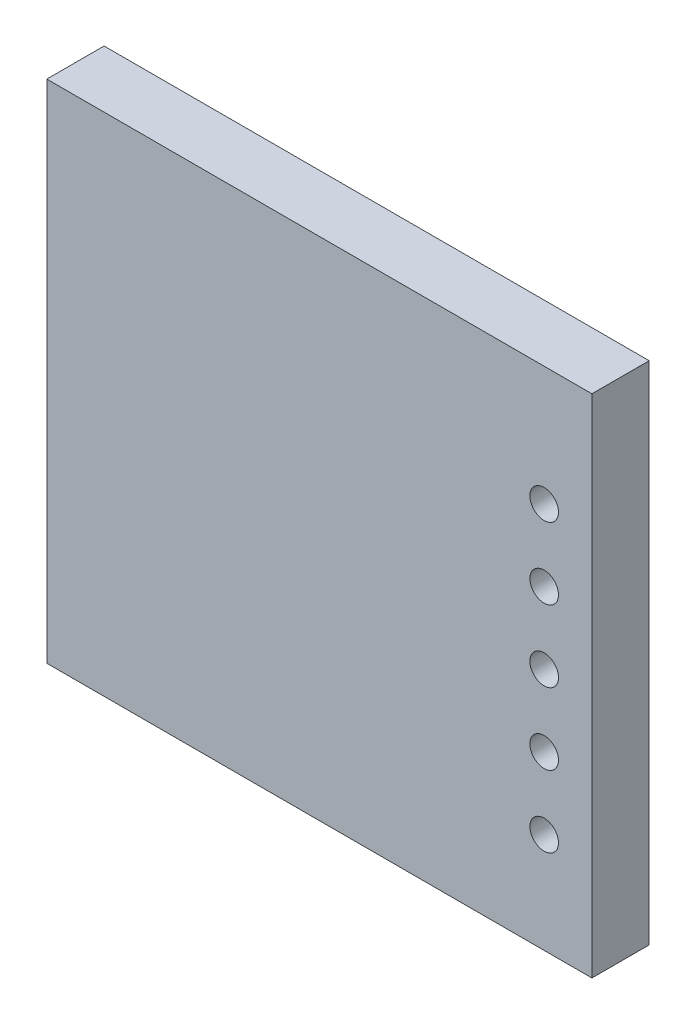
from build123d import *

# Parameters (mm, degrees)
SKETCH1_W           = 14.5034
SKETCH1_H           = 13.462
BOSS_EXTRUDE1_DEPTH = 1.524
SKETCH2_R           = 0.381
CUT_EXTRUDE1_DEPTH  = 6.096


with BuildPart() as part:
    # Sketch1 → Boss-Extrude1 (new body)
    with BuildSketch(Plane.XY):
        with Locations((7.2517, 6.731)):
            Rectangle(SKETCH1_W, SKETCH1_H)
    extrude(amount=BOSS_EXTRUDE1_DEPTH)

    # Sketch2 → Cut-Extrude1 (cut)
    with BuildSketch(Plane.XY.offset(1.524)):
        with Locations((13.2334, 10.287)):
            Circle(SKETCH2_R)
        with Locations((13.2334, 8.382)):
            Circle(SKETCH2_R)
        with Locations((13.2334, 6.477)):
            Circle(SKETCH2_R)
        with Locations((13.2334, 4.572)):
            Circle(SKETCH2_R)
        with Locations((13.2334, 2.667)):
            Circle(SKETCH2_R)
    extrude(amount=-CUT_EXTRUDE1_DEPTH, mode=Mode.SUBTRACT)


solid = part.part
